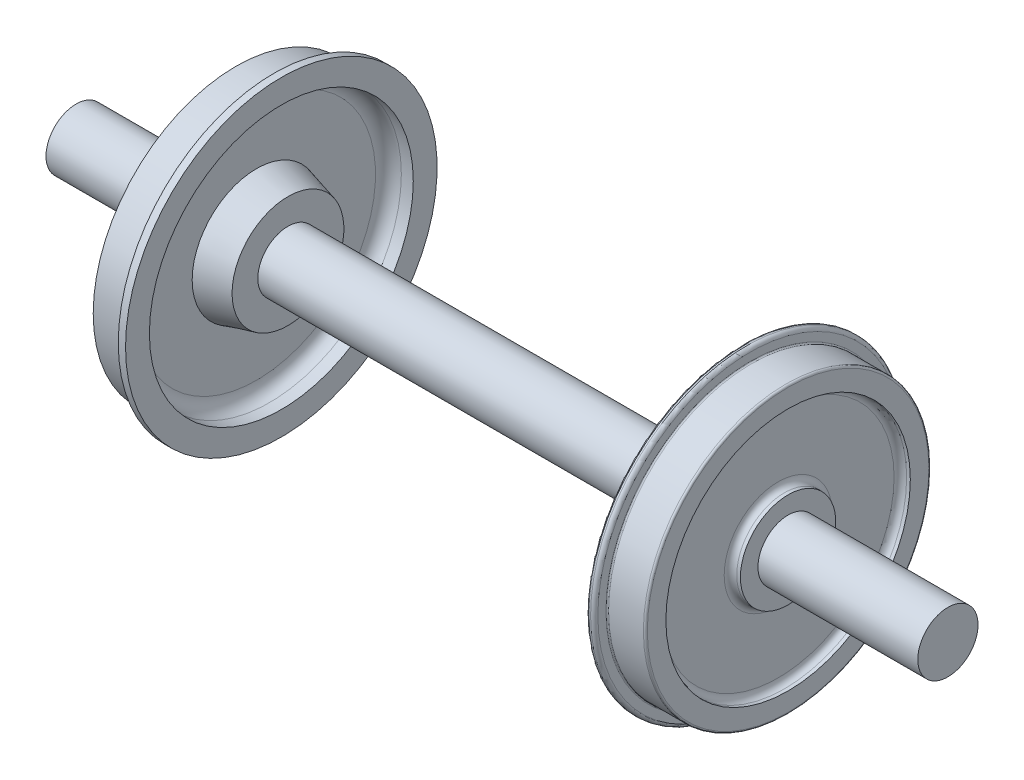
from build123d import *


with BuildPart() as part:
    # Esquisse1 → R_vol.-Mince1 (revolve)
    with BuildSketch(Plane.XY, mode=Mode.PRIVATE) as r_vol_mince1_sk:
        with BuildLine():
            Line((-1315, 0), (-1315, 90))
            Line((-1315, 90), (-832.5, 90))
            Line((-832.5, 90), (-832.5, 143))
            Line((-832.5, 143), (-802.5, 143))
            Line((-802.5, 143), (-802.5, 370))
            Line((-802.5, 370), (-832.5, 370))
            Line((-832.5, 370), (-832.5, 430))
            Line((-832.5, 430), (-717.5, 430))
            Line((-717.5, 430), (-717.5, 469.378670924))
            Line((-717.5, 469.378670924), (-697.5, 469.378670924))
            Line((-697.5, 469.378670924), (-697.5, 399.378670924))
            Line((-697.5, 399.378670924), (-732.5, 399.378670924))
            ThreePointArc((-732.5, 399.378670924), (-760.784271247, 387.662942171), (-772.5, 359.378670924))
            Line((-772.5, 359.378670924), (-772.5, 193.455173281))
            Line((-772.5, 193.455173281), (-677.5, 168))
            Line((-677.5, 168), (-677.5, 90))
            Line((-677.5, 90), (677.5, 90))
            Line((677.5, 90), (677.5, 168))
            Line((677.5, 168), (757.676380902, 189.483196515))
            ThreePointArc((757.676380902, 189.483196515), (768.367066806, 196.62648446), (772.5, 208.801713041))
            Line((772.5, 208.801713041), (772.5, 359.378670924))
            ThreePointArc((772.5, 359.378670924), (760.784271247, 387.662942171), (732.5, 399.378670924))
            Line((732.5, 399.378670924), (702.5, 399.378670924))
            ThreePointArc((702.5, 399.378670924), (698.964466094, 400.843137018), (697.5, 404.378670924))
            Line((697.5, 404.378670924), (697.5, 464.378670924))
            ThreePointArc((697.5, 464.378670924), (698.964466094, 467.91420483), (702.5, 469.378670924))
            Line((702.5, 469.378670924), (707.5, 469.378670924))
            ThreePointArc((707.5, 469.378670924), (714.571067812, 466.449738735), (717.5, 459.378670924))
            Line((717.5, 459.378670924), (717.5, 435))
            ThreePointArc((717.5, 435), (718.964466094, 431.464466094), (722.5, 430))
            Line((722.5, 430), (827.5, 430))
            ThreePointArc((827.5, 430), (831.035533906, 428.535533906), (832.5, 425))
            Line((832.5, 425), (832.5, 370))
            Line((832.5, 370), (822.5, 370))
            ThreePointArc((822.5, 370), (808.357864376, 364.142135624), (802.5, 350))
            Line((802.5, 350), (802.5, 163))
            ThreePointArc((802.5, 163), (808.357864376, 148.857864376), (822.5, 143))
            Line((822.5, 143), (832.5, 143))
            Line((832.5, 143), (832.5, 90))
            Line((832.5, 90), (1315, 90))
            Line((1315, 90), (1315, 0))
            Line((1315, 0), (1316, 0))
            Line((1316, 0), (1316, 91))
            Line((1316, 91), (833.5, 91))
            Line((833.5, 91), (833.5, 144))
            Line((833.5, 144), (822.5, 144))
            ThreePointArc((822.5, 144), (809.064971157, 149.564971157), (803.5, 163))
            Line((803.5, 163), (803.5, 350))
            ThreePointArc((803.5, 350), (809.064971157, 363.435028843), (822.5, 369))
            Line((822.5, 369), (833.5, 369))
            Line((833.5, 369), (833.5, 425))
            ThreePointArc((833.5, 425), (831.742640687, 429.242640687), (827.5, 431))
            Line((827.5, 431), (722.5, 431))
            ThreePointArc((722.5, 431), (719.671572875, 432.171572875), (718.5, 435))
            Line((718.5, 435), (718.5, 459.378670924))
            ThreePointArc((718.5, 459.378670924), (715.278174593, 467.156845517), (707.5, 470.378670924))
            Line((707.5, 470.378670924), (702.5, 470.378670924))
            ThreePointArc((702.5, 470.378670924), (698.257359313, 468.621311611), (696.5, 464.378670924))
            Line((696.5, 464.378670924), (696.5, 404.378670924))
            ThreePointArc((696.5, 404.378670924), (698.257359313, 400.136030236), (702.5, 398.378670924))
            Line((702.5, 398.378670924), (732.5, 398.378670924))
            ThreePointArc((732.5, 398.378670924), (760.077164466, 386.95583539), (771.5, 359.378670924))
            Line((771.5, 359.378670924), (771.5, 208.801713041))
            ThreePointArc((771.5, 208.801713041), (767.573713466, 197.235245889), (757.417561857, 190.449122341))
            Line((757.417561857, 190.449122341), (676.5, 168.767326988))
            Line((676.5, 168.767326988), (676.5, 91))
            Line((676.5, 91), (-676.5, 91))
            Line((-676.5, 91), (-676.5, 168.767326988))
            Line((-676.5, 168.767326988), (-771.5, 194.222500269))
            Line((-771.5, 194.222500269), (-771.5, 359.378670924))
            ThreePointArc((-771.5, 359.378670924), (-760.077164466, 386.95583539), (-732.5, 398.378670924))
            Line((-732.5, 398.378670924), (-696.5, 398.378670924))
            Line((-696.5, 398.378670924), (-696.5, 470.378670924))
            Line((-696.5, 470.378670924), (-718.5, 470.378670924))
            Line((-718.5, 470.378670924), (-718.5, 431))
            Line((-718.5, 431), (-833.5, 431))
            Line((-833.5, 431), (-833.5, 369))
            Line((-833.5, 369), (-803.5, 369))
            Line((-803.5, 369), (-803.5, 144))
            Line((-803.5, 144), (-833.5, 144))
            Line((-833.5, 144), (-833.5, 91))
            Line((-833.5, 91), (-1316, 91))
            Line((-1316, 91), (-1316, 0))
            Line((-1316, 0), (-1315, 0))
        make_face()
    revolve(r_vol_mince1_sk.sketch.rotate(Axis((0, 0, 0), (1, 0, 0)), 90), axis=Axis((0, 0, 0), (1, 0, 0)))


solid = part.part
